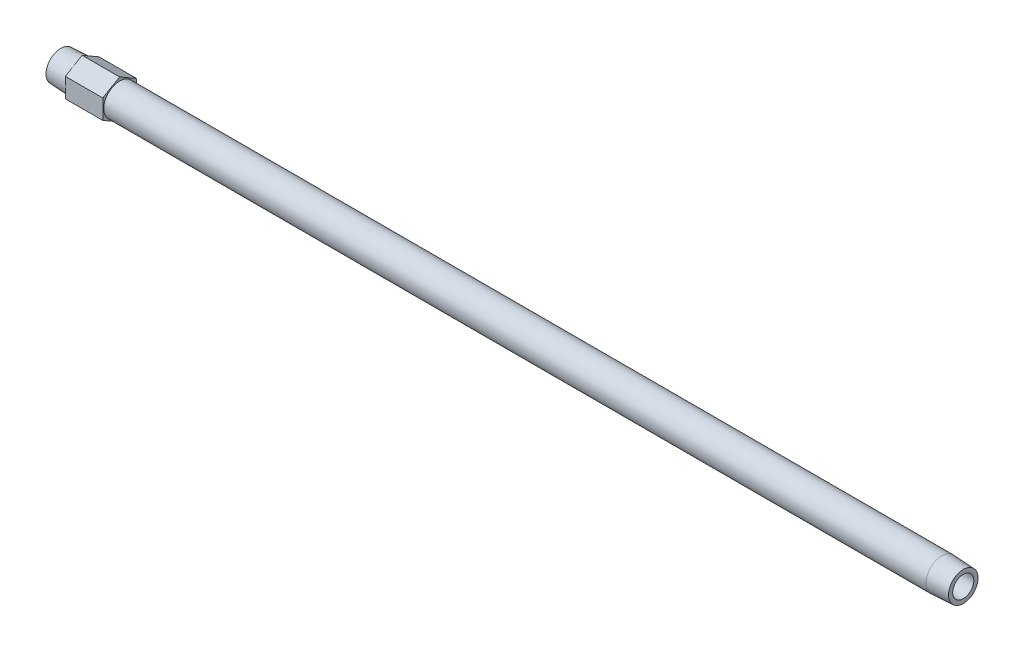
ISO-10303-21;
HEADER;
FILE_DESCRIPTION(('STEP AP214'),'2;1');
FILE_NAME('part.step','',(''),(''),'','','');
FILE_SCHEMA(('AUTOMOTIVE_DESIGN { 1 0 10303 214 1 1 1 1 }'));
ENDSEC;
DATA;
#1=APPLICATION_CONTEXT('core data for automotive mechanical design processes');
#2=APPLICATION_PROTOCOL_DEFINITION('international standard','automotive_design',2000,#1);
#3=PRODUCT_CONTEXT('',#1,'mechanical');
#4=PRODUCT('Part','Part','',(#3));
#5=PRODUCT_RELATED_PRODUCT_CATEGORY('part','',(#4));
#6=PRODUCT_DEFINITION_FORMATION('','',#4);
#7=PRODUCT_DEFINITION_CONTEXT('part definition',#1,'design');
#8=PRODUCT_DEFINITION('design','',#6,#7);
#9=PRODUCT_DEFINITION_SHAPE('','',#8);
#10=(LENGTH_UNIT() NAMED_UNIT(*) SI_UNIT(.MILLI.,.METRE.));
#11=(NAMED_UNIT(*) PLANE_ANGLE_UNIT() SI_UNIT($,.RADIAN.));
#12=(NAMED_UNIT(*) SI_UNIT($,.STERADIAN.) SOLID_ANGLE_UNIT());
#13=UNCERTAINTY_MEASURE_WITH_UNIT(LENGTH_MEASURE(1.E-05),#10,'distance_accuracy_value','');
#14=(GEOMETRIC_REPRESENTATION_CONTEXT(3) GLOBAL_UNCERTAINTY_ASSIGNED_CONTEXT((#13)) GLOBAL_UNIT_ASSIGNED_CONTEXT((#10,
#11,#12)) REPRESENTATION_CONTEXT('',''));
#15=CARTESIAN_POINT('',(0.,0.,0.));
#16=DIRECTION('',(0.,0.,1.));
#17=DIRECTION('',(1.,0.,0.));
#18=AXIS2_PLACEMENT_3D('',#15,#16,#17);
#19=CARTESIAN_POINT('',(0.,0.,-4.78009397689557));
#20=DIRECTION('',(1.,0.,0.));
#21=DIRECTION('',(0.,0.,-1.));
#22=AXIS2_PLACEMENT_3D('',#19,#20,#21);
#23=PLANE('',#22);
#24=CARTESIAN_POINT('',(0.,0.,0.));
#25=DIRECTION('',(-1.,0.,0.));
#26=DIRECTION('',(0.,0.,1.));
#27=AXIS2_PLACEMENT_3D('',#24,#25,#26);
#28=CIRCLE('',#27,4.78009397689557);
#29=CARTESIAN_POINT('',(0.,0.,4.78009397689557));
#30=VERTEX_POINT('',#29);
#31=EDGE_CURVE('E147',#30,#30,#28,.T.);
#32=ORIENTED_EDGE('',*,*,#31,.T.);
#33=EDGE_LOOP('',(#32));
#34=FACE_BOUND('',#33,.T.);
#35=CARTESIAN_POINT('',(0.,0.,0.));
#36=DIRECTION('',(1.,0.,0.));
#37=DIRECTION('',(0.,0.,1.));
#38=AXIS2_PLACEMENT_3D('',#35,#36,#37);
#39=CIRCLE('',#38,3.4163);
#40=CARTESIAN_POINT('',(0.,0.,3.4163));
#41=VERTEX_POINT('',#40);
#42=EDGE_CURVE('E159',#41,#41,#39,.T.);
#43=ORIENTED_EDGE('',*,*,#42,.T.);
#44=EDGE_LOOP('',(#43));
#45=FACE_BOUND('',#44,.T.);
#46=ADVANCED_FACE('F15',(#34,#45),#23,.F.);
#47=CARTESIAN_POINT('',(292.1,0.,-4.78009397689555));
#48=DIRECTION('',(-1.,0.,0.));
#49=DIRECTION('',(0.,0.,1.));
#50=AXIS2_PLACEMENT_3D('',#47,#48,#49);
#51=PLANE('',#50);
#52=CARTESIAN_POINT('',(292.1,0.,0.));
#53=DIRECTION('',(-1.,0.,0.));
#54=DIRECTION('',(0.,0.,1.));
#55=AXIS2_PLACEMENT_3D('',#52,#53,#54);
#56=CIRCLE('',#55,4.78009397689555);
#57=CARTESIAN_POINT('',(292.1,0.,4.78009397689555));
#58=VERTEX_POINT('',#57);
#59=EDGE_CURVE('E150',#58,#58,#56,.T.);
#60=ORIENTED_EDGE('',*,*,#59,.F.);
#61=EDGE_LOOP('',(#60));
#62=FACE_BOUND('',#61,.T.);
#63=CARTESIAN_POINT('',(292.1,0.,0.));
#64=DIRECTION('',(-1.,0.,0.));
#65=DIRECTION('',(0.,0.,1.));
#66=AXIS2_PLACEMENT_3D('',#63,#64,#65);
#67=CIRCLE('',#66,3.4163);
#68=CARTESIAN_POINT('',(292.1,0.,3.4163));
#69=VERTEX_POINT('',#68);
#70=EDGE_CURVE('E156',#69,#69,#67,.F.);
#71=ORIENTED_EDGE('',*,*,#70,.F.);
#72=EDGE_LOOP('',(#71));
#73=FACE_BOUND('',#72,.T.);
#74=ADVANCED_FACE('F178',(#62,#73),#51,.F.);
#75=CARTESIAN_POINT('',(19.05,-9.45872946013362,5.461));
#76=DIRECTION('',(-1.,0.,0.));
#77=DIRECTION('',(0.,-1.,0.));
#78=AXIS2_PLACEMENT_3D('',#75,#76,#77);
#79=PLANE('',#78);
#80=DIRECTION('',(0.,0.5,-0.866025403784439));
#81=VECTOR('',#80,1.);
#82=CARTESIAN_POINT('',(19.05,-6.30581964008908,0.));
#83=LINE('',#82,#81);
#84=CARTESIAN_POINT('',(19.05,-6.30581964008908,0.));
#85=VERTEX_POINT('',#84);
#86=CARTESIAN_POINT('',(19.05,-3.15290982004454,-5.461));
#87=VERTEX_POINT('',#86);
#88=EDGE_CURVE('E103',#85,#87,#83,.T.);
#89=ORIENTED_EDGE('',*,*,#88,.T.);
#90=DIRECTION('',(0.,1.,0.));
#91=VECTOR('',#90,1.);
#92=CARTESIAN_POINT('',(19.05,-3.15290982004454,-5.461));
#93=LINE('',#92,#91);
#94=CARTESIAN_POINT('',(19.05,3.15290982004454,-5.461));
#95=VERTEX_POINT('',#94);
#96=EDGE_CURVE('E83',#87,#95,#93,.T.);
#97=ORIENTED_EDGE('',*,*,#96,.T.);
#98=DIRECTION('',(0.,0.5,0.866025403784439));
#99=VECTOR('',#98,1.);
#100=CARTESIAN_POINT('',(19.05,3.15290982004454,-5.461));
#101=LINE('',#100,#99);
#102=CARTESIAN_POINT('',(19.05,6.30581964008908,0.));
#103=VERTEX_POINT('',#102);
#104=EDGE_CURVE('E102',#95,#103,#101,.T.);
#105=ORIENTED_EDGE('',*,*,#104,.T.);
#106=DIRECTION('',(0.,-0.5,0.866025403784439));
#107=VECTOR('',#106,1.);
#108=CARTESIAN_POINT('',(19.05,6.30581964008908,0.));
#109=LINE('',#108,#107);
#110=CARTESIAN_POINT('',(19.05,3.15290982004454,5.461));
#111=VERTEX_POINT('',#110);
#112=EDGE_CURVE('E105',#103,#111,#109,.T.);
#113=ORIENTED_EDGE('',*,*,#112,.T.);
#114=DIRECTION('',(0.,-1.,0.));
#115=VECTOR('',#114,1.);
#116=CARTESIAN_POINT('',(19.05,3.15290982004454,5.461));
#117=LINE('',#116,#115);
#118=CARTESIAN_POINT('',(19.05,-3.15290982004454,5.461));
#119=VERTEX_POINT('',#118);
#120=EDGE_CURVE('E35',#111,#119,#117,.T.);
#121=ORIENTED_EDGE('',*,*,#120,.T.);
#122=DIRECTION('',(0.,-0.5,-0.866025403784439));
#123=VECTOR('',#122,1.);
#124=CARTESIAN_POINT('',(19.05,-3.15290982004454,5.461));
#125=LINE('',#124,#123);
#126=EDGE_CURVE('E30',#119,#85,#125,.T.);
#127=ORIENTED_EDGE('',*,*,#126,.T.);
#128=EDGE_LOOP('',(#89,#97,#105,#113,#121,#127));
#129=FACE_BOUND('',#128,.T.);
#130=CARTESIAN_POINT('',(19.05,0.,0.));
#131=DIRECTION('',(-1.,0.,0.));
#132=DIRECTION('',(0.,-1.,0.));
#133=AXIS2_PLACEMENT_3D('',#130,#131,#132);
#134=CIRCLE('',#133,5.1435);
#135=CARTESIAN_POINT('',(19.05,-5.1435,0.));
#136=VERTEX_POINT('',#135);
#137=EDGE_CURVE('E89',#136,#136,#134,.F.);
#138=ORIENTED_EDGE('',*,*,#137,.F.);
#139=EDGE_LOOP('',(#138));
#140=FACE_BOUND('',#139,.T.);
#141=ADVANCED_FACE('F124',(#129,#140),#79,.F.);
#142=CARTESIAN_POINT('',(6.9342,-9.45872946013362,5.461));
#143=DIRECTION('',(-1.,0.,0.));
#144=DIRECTION('',(0.,-1.,0.));
#145=AXIS2_PLACEMENT_3D('',#142,#143,#144);
#146=PLANE('',#145);
#147=DIRECTION('',(0.,0.5,-0.866025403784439));
#148=VECTOR('',#147,1.);
#149=CARTESIAN_POINT('',(6.9342,-6.30581964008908,0.));
#150=LINE('',#149,#148);
#151=CARTESIAN_POINT('',(6.9342,-6.30581964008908,0.));
#152=VERTEX_POINT('',#151);
#153=CARTESIAN_POINT('',(6.9342,-3.15290982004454,-5.461));
#154=VERTEX_POINT('',#153);
#155=EDGE_CURVE('E73',#152,#154,#150,.T.);
#156=ORIENTED_EDGE('',*,*,#155,.F.);
#157=DIRECTION('',(0.,-0.5,-0.866025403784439));
#158=VECTOR('',#157,1.);
#159=CARTESIAN_POINT('',(6.9342,-3.15290982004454,5.461));
#160=LINE('',#159,#158);
#161=CARTESIAN_POINT('',(6.9342,-3.15290982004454,5.461));
#162=VERTEX_POINT('',#161);
#163=EDGE_CURVE('E99',#162,#152,#160,.T.);
#164=ORIENTED_EDGE('',*,*,#163,.F.);
#165=DIRECTION('',(0.,-1.,0.));
#166=VECTOR('',#165,1.);
#167=CARTESIAN_POINT('',(6.9342,3.15290982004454,5.461));
#168=LINE('',#167,#166);
#169=CARTESIAN_POINT('',(6.9342,3.15290982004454,5.461));
#170=VERTEX_POINT('',#169);
#171=EDGE_CURVE('E133',#170,#162,#168,.T.);
#172=ORIENTED_EDGE('',*,*,#171,.F.);
#173=DIRECTION('',(0.,-0.5,0.866025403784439));
#174=VECTOR('',#173,1.);
#175=CARTESIAN_POINT('',(6.9342,6.30581964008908,0.));
#176=LINE('',#175,#174);
#177=CARTESIAN_POINT('',(6.9342,6.30581964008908,0.));
#178=VERTEX_POINT('',#177);
#179=EDGE_CURVE('E129',#178,#170,#176,.T.);
#180=ORIENTED_EDGE('',*,*,#179,.F.);
#181=DIRECTION('',(0.,0.5,0.866025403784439));
#182=VECTOR('',#181,1.);
#183=CARTESIAN_POINT('',(6.9342,3.15290982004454,-5.461));
#184=LINE('',#183,#182);
#185=CARTESIAN_POINT('',(6.9342,3.15290982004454,-5.461));
#186=VERTEX_POINT('',#185);
#187=EDGE_CURVE('E75',#186,#178,#184,.T.);
#188=ORIENTED_EDGE('',*,*,#187,.F.);
#189=DIRECTION('',(0.,1.,0.));
#190=VECTOR('',#189,1.);
#191=CARTESIAN_POINT('',(6.9342,-3.15290982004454,-5.461));
#192=LINE('',#191,#190);
#193=EDGE_CURVE('E68',#154,#186,#192,.T.);
#194=ORIENTED_EDGE('',*,*,#193,.F.);
#195=EDGE_LOOP('',(#156,#164,#172,#180,#188,#194));
#196=FACE_BOUND('',#195,.T.);
#197=CARTESIAN_POINT('',(6.9342,0.,0.));
#198=DIRECTION('',(-1.,0.,0.));
#199=DIRECTION('',(0.,0.,1.));
#200=AXIS2_PLACEMENT_3D('',#197,#198,#199);
#201=CIRCLE('',#200,5.1435);
#202=CARTESIAN_POINT('',(6.9342,0.,5.1435));
#203=VERTEX_POINT('',#202);
#204=EDGE_CURVE('E95',#203,#203,#201,.T.);
#205=ORIENTED_EDGE('',*,*,#204,.F.);
#206=EDGE_LOOP('',(#205));
#207=FACE_BOUND('',#206,.T.);
#208=ADVANCED_FACE('F69',(#196,#207),#146,.T.);
#209=CARTESIAN_POINT('',(19.05,-6.30581964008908,0.));
#210=DIRECTION('',(0.,0.866025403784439,0.5));
#211=DIRECTION('',(0.,-0.5,0.866025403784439));
#212=AXIS2_PLACEMENT_3D('',#209,#210,#211);
#213=PLANE('',#212);
#214=ORIENTED_EDGE('',*,*,#155,.T.);
#215=DIRECTION('',(-1.,0.,0.));
#216=VECTOR('',#215,1.);
#217=CARTESIAN_POINT('',(19.05,-3.15290982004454,-5.461));
#218=LINE('',#217,#216);
#219=EDGE_CURVE('E10',#87,#154,#218,.T.);
#220=ORIENTED_EDGE('',*,*,#219,.F.);
#221=ORIENTED_EDGE('',*,*,#88,.F.);
#222=DIRECTION('',(-1.,0.,0.));
#223=VECTOR('',#222,1.);
#224=CARTESIAN_POINT('',(19.05,-6.30581964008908,0.));
#225=LINE('',#224,#223);
#226=EDGE_CURVE('E87',#85,#152,#225,.T.);
#227=ORIENTED_EDGE('',*,*,#226,.T.);
#228=EDGE_LOOP('',(#214,#220,#221,#227));
#229=FACE_BOUND('',#228,.T.);
#230=ADVANCED_FACE('F17',(#229),#213,.F.);
#231=CARTESIAN_POINT('',(19.05,-3.15290982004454,-5.461));
#232=DIRECTION('',(0.,0.,1.));
#233=DIRECTION('',(0.,-1.,0.));
#234=AXIS2_PLACEMENT_3D('',#231,#232,#233);
#235=PLANE('',#234);
#236=ORIENTED_EDGE('',*,*,#193,.T.);
#237=DIRECTION('',(-1.,0.,0.));
#238=VECTOR('',#237,1.);
#239=CARTESIAN_POINT('',(19.05,3.15290982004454,-5.461));
#240=LINE('',#239,#238);
#241=EDGE_CURVE('E23',#95,#186,#240,.T.);
#242=ORIENTED_EDGE('',*,*,#241,.F.);
#243=ORIENTED_EDGE('',*,*,#96,.F.);
#244=ORIENTED_EDGE('',*,*,#219,.T.);
#245=EDGE_LOOP('',(#236,#242,#243,#244));
#246=FACE_BOUND('',#245,.T.);
#247=ADVANCED_FACE('F82',(#246),#235,.F.);
#248=CARTESIAN_POINT('',(19.05,3.15290982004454,-5.461));
#249=DIRECTION('',(0.,-0.866025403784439,0.5));
#250=DIRECTION('',(0.,-0.5,-0.866025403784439));
#251=AXIS2_PLACEMENT_3D('',#248,#249,#250);
#252=PLANE('',#251);
#253=ORIENTED_EDGE('',*,*,#187,.T.);
#254=DIRECTION('',(-1.,0.,0.));
#255=VECTOR('',#254,1.);
#256=CARTESIAN_POINT('',(19.05,6.30581964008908,0.));
#257=LINE('',#256,#255);
#258=EDGE_CURVE('E117',#103,#178,#257,.T.);
#259=ORIENTED_EDGE('',*,*,#258,.F.);
#260=ORIENTED_EDGE('',*,*,#104,.F.);
#261=ORIENTED_EDGE('',*,*,#241,.T.);
#262=EDGE_LOOP('',(#253,#259,#260,#261));
#263=FACE_BOUND('',#262,.T.);
#264=ADVANCED_FACE('F121',(#263),#252,.F.);
#265=CARTESIAN_POINT('',(19.05,6.30581964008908,0.));
#266=DIRECTION('',(0.,-0.866025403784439,-0.5));
#267=DIRECTION('',(0.,0.5,-0.866025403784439));
#268=AXIS2_PLACEMENT_3D('',#265,#266,#267);
#269=PLANE('',#268);
#270=ORIENTED_EDGE('',*,*,#179,.T.);
#271=DIRECTION('',(-1.,0.,0.));
#272=VECTOR('',#271,1.);
#273=CARTESIAN_POINT('',(19.05,3.15290982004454,5.461));
#274=LINE('',#273,#272);
#275=EDGE_CURVE('E114',#111,#170,#274,.T.);
#276=ORIENTED_EDGE('',*,*,#275,.F.);
#277=ORIENTED_EDGE('',*,*,#112,.F.);
#278=ORIENTED_EDGE('',*,*,#258,.T.);
#279=EDGE_LOOP('',(#270,#276,#277,#278));
#280=FACE_BOUND('',#279,.T.);
#281=ADVANCED_FACE('F128',(#280),#269,.F.);
#282=CARTESIAN_POINT('',(19.05,3.15290982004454,5.461));
#283=DIRECTION('',(0.,0.,-1.));
#284=DIRECTION('',(-1.,0.,0.));
#285=AXIS2_PLACEMENT_3D('',#282,#283,#284);
#286=PLANE('',#285);
#287=ORIENTED_EDGE('',*,*,#171,.T.);
#288=DIRECTION('',(-1.,0.,0.));
#289=VECTOR('',#288,1.);
#290=CARTESIAN_POINT('',(19.05,-3.15290982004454,5.461));
#291=LINE('',#290,#289);
#292=EDGE_CURVE('E111',#119,#162,#291,.T.);
#293=ORIENTED_EDGE('',*,*,#292,.F.);
#294=ORIENTED_EDGE('',*,*,#120,.F.);
#295=ORIENTED_EDGE('',*,*,#275,.T.);
#296=EDGE_LOOP('',(#287,#293,#294,#295));
#297=FACE_BOUND('',#296,.T.);
#298=ADVANCED_FACE('F132',(#297),#286,.F.);
#299=CARTESIAN_POINT('',(19.05,-3.15290982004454,5.461));
#300=DIRECTION('',(0.,0.866025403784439,-0.5));
#301=DIRECTION('',(0.,0.5,0.866025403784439));
#302=AXIS2_PLACEMENT_3D('',#299,#300,#301);
#303=PLANE('',#302);
#304=ORIENTED_EDGE('',*,*,#163,.T.);
#305=ORIENTED_EDGE('',*,*,#226,.F.);
#306=ORIENTED_EDGE('',*,*,#126,.F.);
#307=ORIENTED_EDGE('',*,*,#292,.T.);
#308=EDGE_LOOP('',(#304,#305,#306,#307));
#309=FACE_BOUND('',#308,.T.);
#310=ADVANCED_FACE('F135',(#309),#303,.F.);
#311=CARTESIAN_POINT('',(6.9342,0.,0.));
#312=DIRECTION('',(1.,0.,0.));
#313=DIRECTION('',(0.,0.,-1.));
#314=AXIS2_PLACEMENT_3D('',#311,#312,#313);
#315=CONICAL_SURFACE('',#314,5.1435,0.0523598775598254);
#316=ORIENTED_EDGE('',*,*,#31,.F.);
#317=EDGE_LOOP('',(#316));
#318=FACE_BOUND('',#317,.T.);
#319=ORIENTED_EDGE('',*,*,#204,.T.);
#320=EDGE_LOOP('',(#319));
#321=FACE_BOUND('',#320,.T.);
#322=ADVANCED_FACE('F187',(#318,#321),#315,.T.);
#323=CARTESIAN_POINT('',(-60.,0.,0.));
#324=DIRECTION('',(-1.,0.,0.));
#325=DIRECTION('',(0.,0.,1.));
#326=AXIS2_PLACEMENT_3D('',#323,#324,#325);
#327=CYLINDRICAL_SURFACE('',#326,5.1435);
#328=ORIENTED_EDGE('',*,*,#137,.T.);
#329=EDGE_LOOP('',(#328));
#330=FACE_BOUND('',#329,.T.);
#331=CARTESIAN_POINT('',(285.1658,0.,0.));
#332=DIRECTION('',(-1.,0.,0.));
#333=DIRECTION('',(0.,0.,1.));
#334=AXIS2_PLACEMENT_3D('',#331,#332,#333);
#335=CIRCLE('',#334,5.1435);
#336=CARTESIAN_POINT('',(285.1658,0.,5.1435));
#337=VERTEX_POINT('',#336);
#338=EDGE_CURVE('E153',#337,#337,#335,.T.);
#339=ORIENTED_EDGE('',*,*,#338,.T.);
#340=EDGE_LOOP('',(#339));
#341=FACE_BOUND('',#340,.T.);
#342=ADVANCED_FACE('F174',(#330,#341),#327,.T.);
#343=CARTESIAN_POINT('',(292.1,0.,0.));
#344=DIRECTION('',(-1.,0.,0.));
#345=DIRECTION('',(0.,0.,1.));
#346=AXIS2_PLACEMENT_3D('',#343,#344,#345);
#347=CONICAL_SURFACE('',#346,4.78009397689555,0.0523598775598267);
#348=ORIENTED_EDGE('',*,*,#338,.F.);
#349=EDGE_LOOP('',(#348));
#350=FACE_BOUND('',#349,.T.);
#351=ORIENTED_EDGE('',*,*,#59,.T.);
#352=EDGE_LOOP('',(#351));
#353=FACE_BOUND('',#352,.T.);
#354=ADVANCED_FACE('F167',(#350,#353),#347,.T.);
#355=CARTESIAN_POINT('',(292.576064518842,0.,0.));
#356=DIRECTION('',(-1.,0.,0.));
#357=DIRECTION('',(0.,0.,1.));
#358=AXIS2_PLACEMENT_3D('',#355,#356,#357);
#359=CYLINDRICAL_SURFACE('',#358,3.4163);
#360=ORIENTED_EDGE('',*,*,#70,.T.);
#361=EDGE_LOOP('',(#360));
#362=FACE_BOUND('',#361,.T.);
#363=ORIENTED_EDGE('',*,*,#42,.F.);
#364=EDGE_LOOP('',(#363));
#365=FACE_BOUND('',#364,.T.);
#366=ADVANCED_FACE('F165',(#362,#365),#359,.F.);
#367=CLOSED_SHELL('',(#46,#74,#141,#208,#230,#247,#264,#281,#298,#310,#322,#342,#354,#366));
#368=MANIFOLD_SOLID_BREP('B1',#367);
#369=ADVANCED_BREP_SHAPE_REPRESENTATION('',(#18,#368),#14);
#370=SHAPE_DEFINITION_REPRESENTATION(#9,#369);
ENDSEC;
END-ISO-10303-21;
